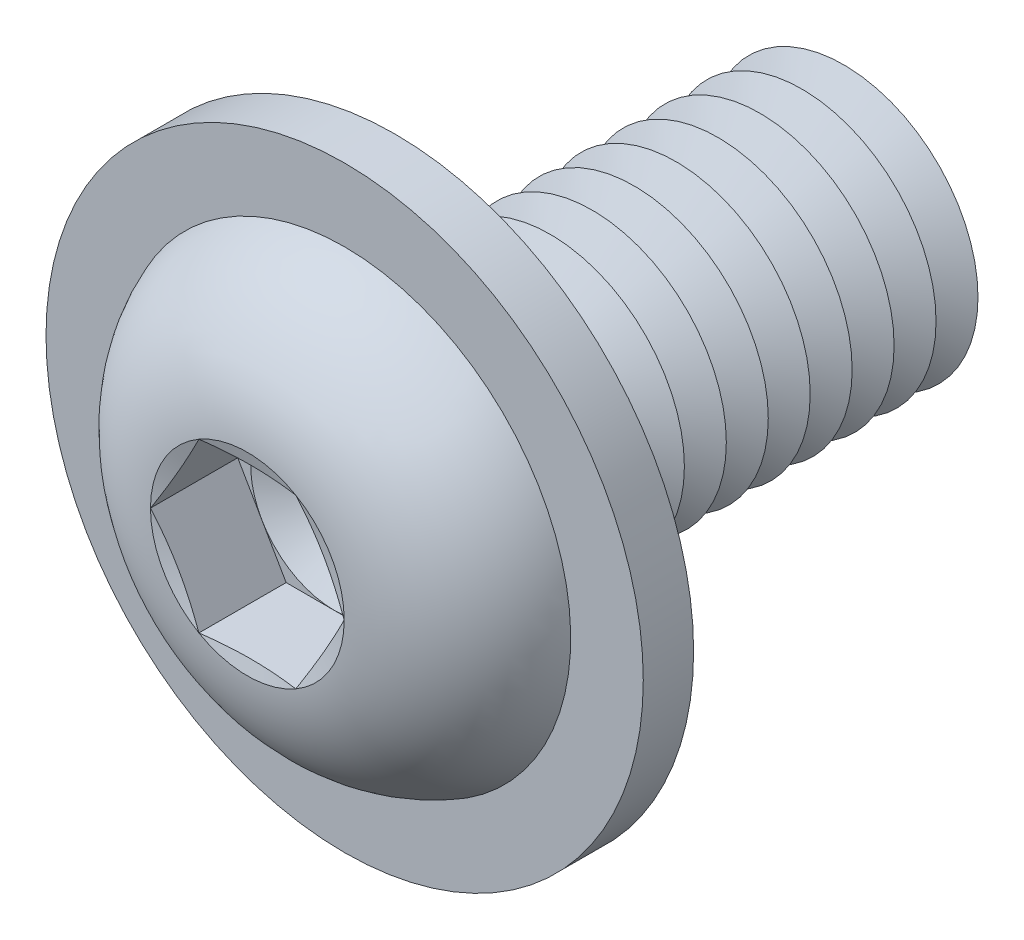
ISO-10303-21;
HEADER;
FILE_DESCRIPTION(('STEP AP214'),'2;1');
FILE_NAME('part.step','',(''),(''),'','','');
FILE_SCHEMA(('AUTOMOTIVE_DESIGN { 1 0 10303 214 1 1 1 1 }'));
ENDSEC;
DATA;
#1=APPLICATION_CONTEXT('core data for automotive mechanical design processes');
#2=APPLICATION_PROTOCOL_DEFINITION('international standard','automotive_design',2000,#1);
#3=PRODUCT_CONTEXT('',#1,'mechanical');
#4=PRODUCT('Part','Part','',(#3));
#5=PRODUCT_RELATED_PRODUCT_CATEGORY('part','',(#4));
#6=PRODUCT_DEFINITION_FORMATION('','',#4);
#7=PRODUCT_DEFINITION_CONTEXT('part definition',#1,'design');
#8=PRODUCT_DEFINITION('design','',#6,#7);
#9=PRODUCT_DEFINITION_SHAPE('','',#8);
#10=(LENGTH_UNIT() NAMED_UNIT(*) SI_UNIT(.MILLI.,.METRE.));
#11=(NAMED_UNIT(*) PLANE_ANGLE_UNIT() SI_UNIT($,.RADIAN.));
#12=(NAMED_UNIT(*) SI_UNIT($,.STERADIAN.) SOLID_ANGLE_UNIT());
#13=UNCERTAINTY_MEASURE_WITH_UNIT(LENGTH_MEASURE(1.E-05),#10,'distance_accuracy_value','');
#14=(GEOMETRIC_REPRESENTATION_CONTEXT(3) GLOBAL_UNCERTAINTY_ASSIGNED_CONTEXT((#13)) GLOBAL_UNIT_ASSIGNED_CONTEXT((#10,
#11,#12)) REPRESENTATION_CONTEXT('',''));
#15=CARTESIAN_POINT('',(0.,0.,0.));
#16=DIRECTION('',(0.,0.,1.));
#17=DIRECTION('',(1.,0.,0.));
#18=AXIS2_PLACEMENT_3D('',#15,#16,#17);
#19=CARTESIAN_POINT('',(0.,0.,-9.625));
#20=DIRECTION('',(0.,0.,1.));
#21=DIRECTION('',(1.,0.,0.));
#22=AXIS2_PLACEMENT_3D('',#19,#20,#21);
#23=CONICAL_SURFACE('',#22,4.,1.0471975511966);
#24=CARTESIAN_POINT('',(0.,0.,-10.25));
#25=DIRECTION('',(0.,0.,1.));
#26=DIRECTION('',(1.,0.,0.));
#27=AXIS2_PLACEMENT_3D('',#24,#25,#26);
#28=CIRCLE('',#27,2.91746824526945);
#29=CARTESIAN_POINT('',(2.91746824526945,0.,-10.25));
#30=VERTEX_POINT('',#29);
#31=EDGE_CURVE('E299',#30,#30,#28,.T.);
#32=ORIENTED_EDGE('',*,*,#31,.T.);
#33=EDGE_LOOP('',(#32));
#34=FACE_BOUND('',#33,.T.);
#35=CARTESIAN_POINT('',(0.,0.,-9.62499999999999));
#36=DIRECTION('',(0.,0.,1.));
#37=DIRECTION('',(1.,0.,0.));
#38=AXIS2_PLACEMENT_3D('',#35,#36,#37);
#39=CIRCLE('',#38,4.);
#40=CARTESIAN_POINT('',(4.,0.,-9.62499999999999));
#41=VERTEX_POINT('',#40);
#42=EDGE_CURVE('E295',#41,#41,#39,.T.);
#43=ORIENTED_EDGE('',*,*,#42,.F.);
#44=EDGE_LOOP('',(#43));
#45=FACE_BOUND('',#44,.T.);
#46=ADVANCED_FACE('F39',(#34,#45),#23,.T.);
#47=CARTESIAN_POINT('',(0.,0.,-10.25));
#48=DIRECTION('',(0.,0.,-1.));
#49=DIRECTION('',(-1.,0.,0.));
#50=AXIS2_PLACEMENT_3D('',#47,#48,#49);
#51=CONICAL_SURFACE('',#50,2.91746824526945,1.0471975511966);
#52=CARTESIAN_POINT('',(0.,0.,-10.875));
#53=DIRECTION('',(0.,0.,1.));
#54=DIRECTION('',(1.,0.,0.));
#55=AXIS2_PLACEMENT_3D('',#52,#53,#54);
#56=CIRCLE('',#55,4.);
#57=CARTESIAN_POINT('',(4.,0.,-10.875));
#58=VERTEX_POINT('',#57);
#59=EDGE_CURVE('E303',#58,#58,#56,.T.);
#60=ORIENTED_EDGE('',*,*,#59,.T.);
#61=EDGE_LOOP('',(#60));
#62=FACE_BOUND('',#61,.T.);
#63=ORIENTED_EDGE('',*,*,#31,.F.);
#64=EDGE_LOOP('',(#63));
#65=FACE_BOUND('',#64,.T.);
#66=ADVANCED_FACE('F436',(#62,#65),#51,.T.);
#67=CARTESIAN_POINT('',(0.,4.00000000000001,-14.));
#68=DIRECTION('',(0.,0.,-1.));
#69=DIRECTION('',(-1.,0.,0.));
#70=AXIS2_PLACEMENT_3D('',#67,#68,#69);
#71=PLANE('',#70);
#72=CARTESIAN_POINT('',(0.,0.,-14.));
#73=DIRECTION('',(0.,0.,1.));
#74=DIRECTION('',(1.,0.,0.));
#75=AXIS2_PLACEMENT_3D('',#72,#73,#74);
#76=CIRCLE('',#75,2.91746824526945);
#77=CARTESIAN_POINT('',(2.91746824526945,0.,-14.));
#78=VERTEX_POINT('',#77);
#79=EDGE_CURVE('E323',#78,#78,#76,.T.);
#80=ORIENTED_EDGE('',*,*,#79,.F.);
#81=EDGE_LOOP('',(#80));
#82=FACE_BOUND('',#81,.T.);
#83=ADVANCED_FACE('F442',(#82),#71,.T.);
#84=CARTESIAN_POINT('',(0.,0.,-13.375));
#85=DIRECTION('',(0.,0.,1.));
#86=DIRECTION('',(1.,0.,0.));
#87=AXIS2_PLACEMENT_3D('',#84,#85,#86);
#88=CONICAL_SURFACE('',#87,4.,1.0471975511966);
#89=ORIENTED_EDGE('',*,*,#79,.T.);
#90=EDGE_LOOP('',(#89));
#91=FACE_BOUND('',#90,.T.);
#92=CARTESIAN_POINT('',(0.,0.,-13.375));
#93=DIRECTION('',(0.,0.,1.));
#94=DIRECTION('',(1.,0.,0.));
#95=AXIS2_PLACEMENT_3D('',#92,#93,#94);
#96=CIRCLE('',#95,4.);
#97=CARTESIAN_POINT('',(4.,0.,-13.375));
#98=VERTEX_POINT('',#97);
#99=EDGE_CURVE('E319',#98,#98,#96,.T.);
#100=ORIENTED_EDGE('',*,*,#99,.F.);
#101=EDGE_LOOP('',(#100));
#102=FACE_BOUND('',#101,.T.);
#103=ADVANCED_FACE('F461',(#91,#102),#88,.T.);
#104=CARTESIAN_POINT('',(0.,0.,-12.75));
#105=DIRECTION('',(0.,0.,-1.));
#106=DIRECTION('',(-1.,0.,0.));
#107=AXIS2_PLACEMENT_3D('',#104,#105,#106);
#108=CONICAL_SURFACE('',#107,2.91746824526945,1.0471975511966);
#109=ORIENTED_EDGE('',*,*,#99,.T.);
#110=EDGE_LOOP('',(#109));
#111=FACE_BOUND('',#110,.T.);
#112=CARTESIAN_POINT('',(0.,0.,-12.75));
#113=DIRECTION('',(0.,0.,1.));
#114=DIRECTION('',(1.,0.,0.));
#115=AXIS2_PLACEMENT_3D('',#112,#113,#114);
#116=CIRCLE('',#115,2.91746824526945);
#117=CARTESIAN_POINT('',(2.91746824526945,0.,-12.75));
#118=VERTEX_POINT('',#117);
#119=EDGE_CURVE('E315',#118,#118,#116,.T.);
#120=ORIENTED_EDGE('',*,*,#119,.F.);
#121=EDGE_LOOP('',(#120));
#122=FACE_BOUND('',#121,.T.);
#123=ADVANCED_FACE('F458',(#111,#122),#108,.T.);
#124=CARTESIAN_POINT('',(0.,0.,-12.125));
#125=DIRECTION('',(0.,0.,1.));
#126=DIRECTION('',(1.,0.,0.));
#127=AXIS2_PLACEMENT_3D('',#124,#125,#126);
#128=CONICAL_SURFACE('',#127,4.,1.0471975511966);
#129=ORIENTED_EDGE('',*,*,#119,.T.);
#130=EDGE_LOOP('',(#129));
#131=FACE_BOUND('',#130,.T.);
#132=CARTESIAN_POINT('',(0.,0.,-12.125));
#133=DIRECTION('',(0.,0.,1.));
#134=DIRECTION('',(1.,0.,0.));
#135=AXIS2_PLACEMENT_3D('',#132,#133,#134);
#136=CIRCLE('',#135,4.);
#137=CARTESIAN_POINT('',(4.,0.,-12.125));
#138=VERTEX_POINT('',#137);
#139=EDGE_CURVE('E311',#138,#138,#136,.T.);
#140=ORIENTED_EDGE('',*,*,#139,.F.);
#141=EDGE_LOOP('',(#140));
#142=FACE_BOUND('',#141,.T.);
#143=ADVANCED_FACE('F452',(#131,#142),#128,.T.);
#144=CARTESIAN_POINT('',(0.,0.,-11.5));
#145=DIRECTION('',(0.,0.,-1.));
#146=DIRECTION('',(-1.,0.,0.));
#147=AXIS2_PLACEMENT_3D('',#144,#145,#146);
#148=CONICAL_SURFACE('',#147,2.91746824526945,1.0471975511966);
#149=ORIENTED_EDGE('',*,*,#139,.T.);
#150=EDGE_LOOP('',(#149));
#151=FACE_BOUND('',#150,.T.);
#152=CARTESIAN_POINT('',(0.,0.,-11.5));
#153=DIRECTION('',(0.,0.,1.));
#154=DIRECTION('',(1.,0.,0.));
#155=AXIS2_PLACEMENT_3D('',#152,#153,#154);
#156=CIRCLE('',#155,2.91746824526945);
#157=CARTESIAN_POINT('',(2.91746824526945,0.,-11.5));
#158=VERTEX_POINT('',#157);
#159=EDGE_CURVE('E307',#158,#158,#156,.T.);
#160=ORIENTED_EDGE('',*,*,#159,.F.);
#161=EDGE_LOOP('',(#160));
#162=FACE_BOUND('',#161,.T.);
#163=ADVANCED_FACE('F448',(#151,#162),#148,.T.);
#164=CARTESIAN_POINT('',(0.,0.,-10.875));
#165=DIRECTION('',(0.,0.,1.));
#166=DIRECTION('',(1.,0.,0.));
#167=AXIS2_PLACEMENT_3D('',#164,#165,#166);
#168=CONICAL_SURFACE('',#167,4.,1.0471975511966);
#169=ORIENTED_EDGE('',*,*,#159,.T.);
#170=EDGE_LOOP('',(#169));
#171=FACE_BOUND('',#170,.T.);
#172=ORIENTED_EDGE('',*,*,#59,.F.);
#173=EDGE_LOOP('',(#172));
#174=FACE_BOUND('',#173,.T.);
#175=ADVANCED_FACE('F451',(#171,#174),#168,.T.);
#176=CARTESIAN_POINT('',(0.,0.,-8.375));
#177=DIRECTION('',(0.,0.,1.));
#178=DIRECTION('',(1.,0.,0.));
#179=AXIS2_PLACEMENT_3D('',#176,#177,#178);
#180=CONICAL_SURFACE('',#179,4.,1.0471975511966);
#181=CARTESIAN_POINT('',(0.,0.,-8.99999999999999));
#182=DIRECTION('',(0.,0.,1.));
#183=DIRECTION('',(1.,0.,0.));
#184=AXIS2_PLACEMENT_3D('',#181,#182,#183);
#185=CIRCLE('',#184,2.91746824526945);
#186=CARTESIAN_POINT('',(2.91746824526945,0.,-8.99999999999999));
#187=VERTEX_POINT('',#186);
#188=EDGE_CURVE('E291',#187,#187,#185,.T.);
#189=ORIENTED_EDGE('',*,*,#188,.T.);
#190=EDGE_LOOP('',(#189));
#191=FACE_BOUND('',#190,.T.);
#192=CARTESIAN_POINT('',(0.,0.,-8.37499999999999));
#193=DIRECTION('',(0.,0.,1.));
#194=DIRECTION('',(1.,0.,0.));
#195=AXIS2_PLACEMENT_3D('',#192,#193,#194);
#196=CIRCLE('',#195,4.);
#197=CARTESIAN_POINT('',(4.,0.,-8.37499999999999));
#198=VERTEX_POINT('',#197);
#199=EDGE_CURVE('E287',#198,#198,#196,.T.);
#200=ORIENTED_EDGE('',*,*,#199,.F.);
#201=EDGE_LOOP('',(#200));
#202=FACE_BOUND('',#201,.T.);
#203=ADVANCED_FACE('F456',(#191,#202),#180,.T.);
#204=CARTESIAN_POINT('',(0.,0.,-8.99999999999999));
#205=DIRECTION('',(0.,0.,-1.));
#206=DIRECTION('',(-1.,0.,0.));
#207=AXIS2_PLACEMENT_3D('',#204,#205,#206);
#208=CONICAL_SURFACE('',#207,2.91746824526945,1.0471975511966);
#209=ORIENTED_EDGE('',*,*,#42,.T.);
#210=EDGE_LOOP('',(#209));
#211=FACE_BOUND('',#210,.T.);
#212=ORIENTED_EDGE('',*,*,#188,.F.);
#213=EDGE_LOOP('',(#212));
#214=FACE_BOUND('',#213,.T.);
#215=ADVANCED_FACE('F507',(#211,#214),#208,.T.);
#216=CARTESIAN_POINT('',(0.,0.,-7.125));
#217=DIRECTION('',(0.,0.,1.));
#218=DIRECTION('',(1.,0.,0.));
#219=AXIS2_PLACEMENT_3D('',#216,#217,#218);
#220=CONICAL_SURFACE('',#219,4.,1.0471975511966);
#221=CARTESIAN_POINT('',(0.,0.,-7.74999999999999));
#222=DIRECTION('',(0.,0.,1.));
#223=DIRECTION('',(1.,0.,0.));
#224=AXIS2_PLACEMENT_3D('',#221,#222,#223);
#225=CIRCLE('',#224,2.91746824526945);
#226=CARTESIAN_POINT('',(2.91746824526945,0.,-7.74999999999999));
#227=VERTEX_POINT('',#226);
#228=EDGE_CURVE('E283',#227,#227,#225,.T.);
#229=ORIENTED_EDGE('',*,*,#228,.T.);
#230=EDGE_LOOP('',(#229));
#231=FACE_BOUND('',#230,.T.);
#232=CARTESIAN_POINT('',(0.,0.,-7.125));
#233=DIRECTION('',(0.,0.,1.));
#234=DIRECTION('',(1.,0.,0.));
#235=AXIS2_PLACEMENT_3D('',#232,#233,#234);
#236=CIRCLE('',#235,4.);
#237=CARTESIAN_POINT('',(4.,0.,-7.125));
#238=VERTEX_POINT('',#237);
#239=EDGE_CURVE('E279',#238,#238,#236,.T.);
#240=ORIENTED_EDGE('',*,*,#239,.F.);
#241=EDGE_LOOP('',(#240));
#242=FACE_BOUND('',#241,.T.);
#243=ADVANCED_FACE('F513',(#231,#242),#220,.T.);
#244=CARTESIAN_POINT('',(0.,0.,-7.74999999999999));
#245=DIRECTION('',(0.,0.,-1.));
#246=DIRECTION('',(-1.,0.,0.));
#247=AXIS2_PLACEMENT_3D('',#244,#245,#246);
#248=CONICAL_SURFACE('',#247,2.91746824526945,1.0471975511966);
#249=ORIENTED_EDGE('',*,*,#199,.T.);
#250=EDGE_LOOP('',(#249));
#251=FACE_BOUND('',#250,.T.);
#252=ORIENTED_EDGE('',*,*,#228,.F.);
#253=EDGE_LOOP('',(#252));
#254=FACE_BOUND('',#253,.T.);
#255=ADVANCED_FACE('F520',(#251,#254),#248,.T.);
#256=CARTESIAN_POINT('',(0.,0.,-5.875));
#257=DIRECTION('',(0.,0.,1.));
#258=DIRECTION('',(1.,0.,0.));
#259=AXIS2_PLACEMENT_3D('',#256,#257,#258);
#260=CONICAL_SURFACE('',#259,4.,1.0471975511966);
#261=CARTESIAN_POINT('',(0.,0.,-6.5));
#262=DIRECTION('',(0.,0.,1.));
#263=DIRECTION('',(1.,0.,0.));
#264=AXIS2_PLACEMENT_3D('',#261,#262,#263);
#265=CIRCLE('',#264,2.91746824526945);
#266=CARTESIAN_POINT('',(2.91746824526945,0.,-6.5));
#267=VERTEX_POINT('',#266);
#268=EDGE_CURVE('E275',#267,#267,#265,.T.);
#269=ORIENTED_EDGE('',*,*,#268,.T.);
#270=EDGE_LOOP('',(#269));
#271=FACE_BOUND('',#270,.T.);
#272=CARTESIAN_POINT('',(0.,0.,-5.87499999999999));
#273=DIRECTION('',(0.,0.,1.));
#274=DIRECTION('',(1.,0.,0.));
#275=AXIS2_PLACEMENT_3D('',#272,#273,#274);
#276=CIRCLE('',#275,4.);
#277=CARTESIAN_POINT('',(4.,0.,-5.87499999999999));
#278=VERTEX_POINT('',#277);
#279=EDGE_CURVE('E271',#278,#278,#276,.T.);
#280=ORIENTED_EDGE('',*,*,#279,.F.);
#281=EDGE_LOOP('',(#280));
#282=FACE_BOUND('',#281,.T.);
#283=ADVANCED_FACE('F527',(#271,#282),#260,.T.);
#284=CARTESIAN_POINT('',(0.,0.,-6.5));
#285=DIRECTION('',(0.,0.,-1.));
#286=DIRECTION('',(-1.,0.,0.));
#287=AXIS2_PLACEMENT_3D('',#284,#285,#286);
#288=CONICAL_SURFACE('',#287,2.91746824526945,1.0471975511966);
#289=ORIENTED_EDGE('',*,*,#239,.T.);
#290=EDGE_LOOP('',(#289));
#291=FACE_BOUND('',#290,.T.);
#292=ORIENTED_EDGE('',*,*,#268,.F.);
#293=EDGE_LOOP('',(#292));
#294=FACE_BOUND('',#293,.T.);
#295=ADVANCED_FACE('F534',(#291,#294),#288,.T.);
#296=CARTESIAN_POINT('',(0.,0.,-4.625));
#297=DIRECTION('',(0.,0.,1.));
#298=DIRECTION('',(1.,0.,0.));
#299=AXIS2_PLACEMENT_3D('',#296,#297,#298);
#300=CONICAL_SURFACE('',#299,4.,1.0471975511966);
#301=CARTESIAN_POINT('',(0.,0.,-5.24999999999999));
#302=DIRECTION('',(0.,0.,1.));
#303=DIRECTION('',(1.,0.,0.));
#304=AXIS2_PLACEMENT_3D('',#301,#302,#303);
#305=CIRCLE('',#304,2.91746824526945);
#306=CARTESIAN_POINT('',(2.91746824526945,0.,-5.24999999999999));
#307=VERTEX_POINT('',#306);
#308=EDGE_CURVE('E267',#307,#307,#305,.T.);
#309=ORIENTED_EDGE('',*,*,#308,.T.);
#310=EDGE_LOOP('',(#309));
#311=FACE_BOUND('',#310,.T.);
#312=CARTESIAN_POINT('',(0.,0.,-4.625));
#313=DIRECTION('',(0.,0.,1.));
#314=DIRECTION('',(1.,0.,0.));
#315=AXIS2_PLACEMENT_3D('',#312,#313,#314);
#316=CIRCLE('',#315,4.);
#317=CARTESIAN_POINT('',(4.,0.,-4.625));
#318=VERTEX_POINT('',#317);
#319=EDGE_CURVE('E263',#318,#318,#316,.T.);
#320=ORIENTED_EDGE('',*,*,#319,.F.);
#321=EDGE_LOOP('',(#320));
#322=FACE_BOUND('',#321,.T.);
#323=ADVANCED_FACE('F541',(#311,#322),#300,.T.);
#324=CARTESIAN_POINT('',(0.,0.,-5.24999999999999));
#325=DIRECTION('',(0.,0.,-1.));
#326=DIRECTION('',(-1.,0.,0.));
#327=AXIS2_PLACEMENT_3D('',#324,#325,#326);
#328=CONICAL_SURFACE('',#327,2.91746824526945,1.0471975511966);
#329=ORIENTED_EDGE('',*,*,#279,.T.);
#330=EDGE_LOOP('',(#329));
#331=FACE_BOUND('',#330,.T.);
#332=ORIENTED_EDGE('',*,*,#308,.F.);
#333=EDGE_LOOP('',(#332));
#334=FACE_BOUND('',#333,.T.);
#335=ADVANCED_FACE('F548',(#331,#334),#328,.T.);
#336=CARTESIAN_POINT('',(0.,0.,-3.375));
#337=DIRECTION('',(0.,0.,1.));
#338=DIRECTION('',(1.,0.,0.));
#339=AXIS2_PLACEMENT_3D('',#336,#337,#338);
#340=CONICAL_SURFACE('',#339,4.,1.0471975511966);
#341=CARTESIAN_POINT('',(0.,0.,-3.99999999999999));
#342=DIRECTION('',(0.,0.,1.));
#343=DIRECTION('',(1.,0.,0.));
#344=AXIS2_PLACEMENT_3D('',#341,#342,#343);
#345=CIRCLE('',#344,2.91746824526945);
#346=CARTESIAN_POINT('',(2.91746824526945,0.,-3.99999999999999));
#347=VERTEX_POINT('',#346);
#348=EDGE_CURVE('E259',#347,#347,#345,.T.);
#349=ORIENTED_EDGE('',*,*,#348,.T.);
#350=EDGE_LOOP('',(#349));
#351=FACE_BOUND('',#350,.T.);
#352=CARTESIAN_POINT('',(0.,0.,-3.375));
#353=DIRECTION('',(0.,0.,1.));
#354=DIRECTION('',(1.,0.,0.));
#355=AXIS2_PLACEMENT_3D('',#352,#353,#354);
#356=CIRCLE('',#355,4.);
#357=CARTESIAN_POINT('',(4.,0.,-3.375));
#358=VERTEX_POINT('',#357);
#359=EDGE_CURVE('E255',#358,#358,#356,.T.);
#360=ORIENTED_EDGE('',*,*,#359,.F.);
#361=EDGE_LOOP('',(#360));
#362=FACE_BOUND('',#361,.T.);
#363=ADVANCED_FACE('F555',(#351,#362),#340,.T.);
#364=CARTESIAN_POINT('',(0.,0.,-3.99999999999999));
#365=DIRECTION('',(0.,0.,-1.));
#366=DIRECTION('',(-1.,0.,0.));
#367=AXIS2_PLACEMENT_3D('',#364,#365,#366);
#368=CONICAL_SURFACE('',#367,2.91746824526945,1.0471975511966);
#369=ORIENTED_EDGE('',*,*,#319,.T.);
#370=EDGE_LOOP('',(#369));
#371=FACE_BOUND('',#370,.T.);
#372=ORIENTED_EDGE('',*,*,#348,.F.);
#373=EDGE_LOOP('',(#372));
#374=FACE_BOUND('',#373,.T.);
#375=ADVANCED_FACE('F562',(#371,#374),#368,.T.);
#376=CARTESIAN_POINT('',(0.,0.,-2.125));
#377=DIRECTION('',(0.,0.,1.));
#378=DIRECTION('',(1.,0.,0.));
#379=AXIS2_PLACEMENT_3D('',#376,#377,#378);
#380=CONICAL_SURFACE('',#379,4.,1.0471975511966);
#381=CARTESIAN_POINT('',(0.,0.,-2.75));
#382=DIRECTION('',(0.,0.,1.));
#383=DIRECTION('',(1.,0.,0.));
#384=AXIS2_PLACEMENT_3D('',#381,#382,#383);
#385=CIRCLE('',#384,2.91746824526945);
#386=CARTESIAN_POINT('',(2.91746824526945,0.,-2.75));
#387=VERTEX_POINT('',#386);
#388=EDGE_CURVE('E251',#387,#387,#385,.T.);
#389=ORIENTED_EDGE('',*,*,#388,.T.);
#390=EDGE_LOOP('',(#389));
#391=FACE_BOUND('',#390,.T.);
#392=CARTESIAN_POINT('',(0.,0.,-2.125));
#393=DIRECTION('',(0.,0.,1.));
#394=DIRECTION('',(1.,0.,0.));
#395=AXIS2_PLACEMENT_3D('',#392,#393,#394);
#396=CIRCLE('',#395,4.);
#397=CARTESIAN_POINT('',(4.,0.,-2.125));
#398=VERTEX_POINT('',#397);
#399=EDGE_CURVE('E243',#398,#398,#396,.T.);
#400=ORIENTED_EDGE('',*,*,#399,.F.);
#401=EDGE_LOOP('',(#400));
#402=FACE_BOUND('',#401,.T.);
#403=ADVANCED_FACE('F569',(#391,#402),#380,.T.);
#404=CARTESIAN_POINT('',(0.,0.,-2.75));
#405=DIRECTION('',(0.,0.,-1.));
#406=DIRECTION('',(-1.,0.,0.));
#407=AXIS2_PLACEMENT_3D('',#404,#405,#406);
#408=CONICAL_SURFACE('',#407,2.91746824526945,1.0471975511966);
#409=ORIENTED_EDGE('',*,*,#359,.T.);
#410=EDGE_LOOP('',(#409));
#411=FACE_BOUND('',#410,.T.);
#412=ORIENTED_EDGE('',*,*,#388,.F.);
#413=EDGE_LOOP('',(#412));
#414=FACE_BOUND('',#413,.T.);
#415=ADVANCED_FACE('F576',(#411,#414),#408,.T.);
#416=CARTESIAN_POINT('',(0.,0.,-0.874999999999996));
#417=DIRECTION('',(0.,0.,1.));
#418=DIRECTION('',(1.,0.,0.));
#419=AXIS2_PLACEMENT_3D('',#416,#417,#418);
#420=CONICAL_SURFACE('',#419,4.,1.0471975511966);
#421=CARTESIAN_POINT('',(0.,0.,-1.49999999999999));
#422=DIRECTION('',(0.,0.,1.));
#423=DIRECTION('',(1.,0.,0.));
#424=AXIS2_PLACEMENT_3D('',#421,#422,#423);
#425=CIRCLE('',#424,2.91746824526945);
#426=CARTESIAN_POINT('',(2.91746824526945,0.,-1.49999999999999));
#427=VERTEX_POINT('',#426);
#428=EDGE_CURVE('E232',#427,#427,#425,.T.);
#429=ORIENTED_EDGE('',*,*,#428,.T.);
#430=EDGE_LOOP('',(#429));
#431=FACE_BOUND('',#430,.T.);
#432=CARTESIAN_POINT('',(0.,0.,-0.874999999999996));
#433=DIRECTION('',(0.,0.,1.));
#434=DIRECTION('',(1.,0.,0.));
#435=AXIS2_PLACEMENT_3D('',#432,#433,#434);
#436=CIRCLE('',#435,4.);
#437=CARTESIAN_POINT('',(4.,0.,-0.874999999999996));
#438=VERTEX_POINT('',#437);
#439=EDGE_CURVE('E247',#438,#438,#436,.T.);
#440=ORIENTED_EDGE('',*,*,#439,.F.);
#441=EDGE_LOOP('',(#440));
#442=FACE_BOUND('',#441,.T.);
#443=ADVANCED_FACE('F583',(#431,#442),#420,.T.);
#444=CARTESIAN_POINT('',(0.,0.,-1.49999999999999));
#445=DIRECTION('',(0.,0.,-1.));
#446=DIRECTION('',(-1.,0.,0.));
#447=AXIS2_PLACEMENT_3D('',#444,#445,#446);
#448=CONICAL_SURFACE('',#447,2.91746824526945,1.0471975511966);
#449=ORIENTED_EDGE('',*,*,#399,.T.);
#450=EDGE_LOOP('',(#449));
#451=FACE_BOUND('',#450,.T.);
#452=ORIENTED_EDGE('',*,*,#428,.F.);
#453=EDGE_LOOP('',(#452));
#454=FACE_BOUND('',#453,.T.);
#455=ADVANCED_FACE('F221',(#451,#454),#448,.T.);
#456=CARTESIAN_POINT('',(0.,4.,0.));
#457=DIRECTION('',(0.,0.,-1.));
#458=DIRECTION('',(-1.,0.,0.));
#459=AXIS2_PLACEMENT_3D('',#456,#457,#458);
#460=PLANE('',#459);
#461=CARTESIAN_POINT('',(0.,0.,0.));
#462=DIRECTION('',(0.,0.,-1.));
#463=DIRECTION('',(-1.,0.,0.));
#464=AXIS2_PLACEMENT_3D('',#461,#462,#463);
#465=CIRCLE('',#464,4.625);
#466=CARTESIAN_POINT('',(-4.625,0.,0.));
#467=VERTEX_POINT('',#466);
#468=EDGE_CURVE('E337',#467,#467,#465,.F.);
#469=ORIENTED_EDGE('',*,*,#468,.T.);
#470=EDGE_LOOP('',(#469));
#471=FACE_BOUND('',#470,.T.);
#472=CARTESIAN_POINT('',(0.,0.,0.));
#473=DIRECTION('',(0.,0.,-1.));
#474=DIRECTION('',(0.,1.,0.));
#475=AXIS2_PLACEMENT_3D('',#472,#473,#474);
#476=CIRCLE('',#475,8.9);
#477=CARTESIAN_POINT('',(0.,8.9,0.));
#478=VERTEX_POINT('',#477);
#479=EDGE_CURVE('E904',#478,#478,#476,.T.);
#480=ORIENTED_EDGE('',*,*,#479,.T.);
#481=EDGE_LOOP('',(#480));
#482=FACE_BOUND('',#481,.T.);
#483=ADVANCED_FACE('F595',(#471,#482),#460,.T.);
#484=CARTESIAN_POINT('',(0.,0.,-0.624999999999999));
#485=DIRECTION('',(0.,0.,-1.));
#486=DIRECTION('',(-1.,0.,0.));
#487=AXIS2_PLACEMENT_3D('',#484,#485,#486);
#488=TOROIDAL_SURFACE('',#487,4.625,0.625);
#489=ORIENTED_EDGE('',*,*,#468,.F.);
#490=EDGE_LOOP('',(#489));
#491=FACE_BOUND('',#490,.T.);
#492=CARTESIAN_POINT('',(0.,0.,-0.624999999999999));
#493=DIRECTION('',(0.,0.,-1.));
#494=DIRECTION('',(-1.,0.,0.));
#495=AXIS2_PLACEMENT_3D('',#492,#493,#494);
#496=CIRCLE('',#495,4.);
#497=CARTESIAN_POINT('',(-4.,0.,-0.624999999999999));
#498=VERTEX_POINT('',#497);
#499=EDGE_CURVE('E332',#498,#498,#496,.T.);
#500=ORIENTED_EDGE('',*,*,#499,.F.);
#501=EDGE_LOOP('',(#500));
#502=FACE_BOUND('',#501,.T.);
#503=ADVANCED_FACE('F41',(#491,#502),#488,.F.);
#504=CARTESIAN_POINT('',(0.,0.,-14.));
#505=DIRECTION('',(0.,0.,-1.));
#506=DIRECTION('',(-1.,0.,0.));
#507=AXIS2_PLACEMENT_3D('',#504,#505,#506);
#508=CYLINDRICAL_SURFACE('',#507,4.);
#509=ORIENTED_EDGE('',*,*,#499,.T.);
#510=EDGE_LOOP('',(#509));
#511=FACE_BOUND('',#510,.T.);
#512=ORIENTED_EDGE('',*,*,#439,.T.);
#513=EDGE_LOOP('',(#512));
#514=FACE_BOUND('',#513,.T.);
#515=ADVANCED_FACE('F607',(#511,#514),#508,.T.);
#516=CARTESIAN_POINT('',(0.,0.,1.5));
#517=DIRECTION('',(0.,0.,-1.));
#518=DIRECTION('',(0.,1.,0.));
#519=AXIS2_PLACEMENT_3D('',#516,#517,#518);
#520=CYLINDRICAL_SURFACE('',#519,8.9);
#521=CARTESIAN_POINT('',(0.,0.,1.5));
#522=DIRECTION('',(0.,0.,-1.));
#523=DIRECTION('',(0.,1.,0.));
#524=AXIS2_PLACEMENT_3D('',#521,#522,#523);
#525=CIRCLE('',#524,8.9);
#526=CARTESIAN_POINT('',(0.,8.9,1.5));
#527=VERTEX_POINT('',#526);
#528=EDGE_CURVE('E902',#527,#527,#525,.T.);
#529=ORIENTED_EDGE('',*,*,#528,.T.);
#530=EDGE_LOOP('',(#529));
#531=FACE_BOUND('',#530,.T.);
#532=ORIENTED_EDGE('',*,*,#479,.F.);
#533=EDGE_LOOP('',(#532));
#534=FACE_BOUND('',#533,.T.);
#535=ADVANCED_FACE('F613',(#531,#534),#520,.T.);
#536=CARTESIAN_POINT('',(0.,0.,1.5));
#537=DIRECTION('',(0.,0.,-1.));
#538=DIRECTION('',(0.,1.,0.));
#539=AXIS2_PLACEMENT_3D('',#536,#537,#538);
#540=PLANE('',#539);
#541=CARTESIAN_POINT('',(0.,0.,1.5));
#542=DIRECTION('',(0.,0.,-1.));
#543=DIRECTION('',(0.,1.,0.));
#544=AXIS2_PLACEMENT_3D('',#541,#542,#543);
#545=CIRCLE('',#544,6.73705889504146);
#546=CARTESIAN_POINT('',(0.,6.73705889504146,1.5));
#547=VERTEX_POINT('',#546);
#548=EDGE_CURVE('E43',#547,#547,#545,.F.);
#549=ORIENTED_EDGE('',*,*,#548,.F.);
#550=EDGE_LOOP('',(#549));
#551=FACE_BOUND('',#550,.T.);
#552=ORIENTED_EDGE('',*,*,#528,.F.);
#553=EDGE_LOOP('',(#552));
#554=FACE_BOUND('',#553,.T.);
#555=ADVANCED_FACE('F117',(#551,#554),#540,.F.);
#556=CARTESIAN_POINT('',(0.,0.,1.8));
#557=DIRECTION('',(0.,0.,1.));
#558=DIRECTION('',(1.,0.,0.));
#559=AXIS2_PLACEMENT_3D('',#556,#557,#558);
#560=CONICAL_SURFACE('',#559,2.49999883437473,1.0471975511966);
#561=CARTESIAN_POINT('',(0.,0.,0.35662500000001));
#562=VERTEX_POINT('',#561);
#563=VERTEX_LOOP('',#562);
#564=FACE_BOUND('',#563,.T.);
#565=CARTESIAN_POINT('',(0.,0.,1.8));
#566=DIRECTION('',(0.,0.,1.));
#567=DIRECTION('',(1.,0.,0.));
#568=AXIS2_PLACEMENT_3D('',#565,#566,#567);
#569=CIRCLE('',#568,2.49999883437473);
#570=CARTESIAN_POINT('',(2.1650625,1.24999941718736,1.8));
#571=VERTEX_POINT('',#570);
#572=CARTESIAN_POINT('',(0.,2.49999883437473,1.8));
#573=VERTEX_POINT('',#572);
#574=EDGE_CURVE('E120',#571,#573,#569,.T.);
#575=ORIENTED_EDGE('',*,*,#574,.T.);
#576=CARTESIAN_POINT('',(0.,0.,1.8));
#577=DIRECTION('',(0.,0.,1.));
#578=DIRECTION('',(1.,0.,0.));
#579=AXIS2_PLACEMENT_3D('',#576,#577,#578);
#580=CIRCLE('',#579,2.49999883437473);
#581=CARTESIAN_POINT('',(-2.1650625,1.24999941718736,1.8));
#582=VERTEX_POINT('',#581);
#583=EDGE_CURVE('E11',#573,#582,#580,.T.);
#584=ORIENTED_EDGE('',*,*,#583,.T.);
#585=CARTESIAN_POINT('',(-2.1650625,-1.24999941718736,1.8));
#586=VERTEX_POINT('',#585);
#587=EDGE_CURVE('E49',#582,#586,#580,.T.);
#588=ORIENTED_EDGE('',*,*,#587,.T.);
#589=CARTESIAN_POINT('',(0.,-2.49999883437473,1.8));
#590=VERTEX_POINT('',#589);
#591=EDGE_CURVE('E344',#586,#590,#580,.T.);
#592=ORIENTED_EDGE('',*,*,#591,.T.);
#593=CARTESIAN_POINT('',(2.1650625,-1.24999941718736,1.8));
#594=VERTEX_POINT('',#593);
#595=EDGE_CURVE('E57',#590,#594,#580,.T.);
#596=ORIENTED_EDGE('',*,*,#595,.T.);
#597=EDGE_CURVE('E50',#594,#571,#580,.T.);
#598=ORIENTED_EDGE('',*,*,#597,.T.);
#599=EDGE_LOOP('',(#575,#584,#588,#592,#596,#598));
#600=FACE_BOUND('',#599,.T.);
#601=ADVANCED_FACE('F114',(#564,#600),#560,.F.);
#602=CARTESIAN_POINT('',(0.,0.,1.8));
#603=DIRECTION('',(0.,0.,1.));
#604=DIRECTION('',(1.,0.,0.));
#605=AXIS2_PLACEMENT_3D('',#602,#603,#604);
#606=PLANE('',#605);
#607=ORIENTED_EDGE('',*,*,#591,.F.);
#608=DIRECTION('',(0.5,-0.866025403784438,0.));
#609=VECTOR('',#608,1.);
#610=CARTESIAN_POINT('',(-2.88675,0.,1.8));
#611=LINE('',#610,#609);
#612=CARTESIAN_POINT('',(-1.443375,-2.49999883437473,1.8));
#613=VERTEX_POINT('',#612);
#614=EDGE_CURVE('E154',#586,#613,#611,.T.);
#615=ORIENTED_EDGE('',*,*,#614,.T.);
#616=DIRECTION('',(1.,0.,0.));
#617=VECTOR('',#616,1.);
#618=CARTESIAN_POINT('',(-1.443375,-2.49999883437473,1.8));
#619=LINE('',#618,#617);
#620=EDGE_CURVE('E160',#613,#590,#619,.T.);
#621=ORIENTED_EDGE('',*,*,#620,.T.);
#622=EDGE_LOOP('',(#607,#615,#621));
#623=FACE_BOUND('',#622,.T.);
#624=ADVANCED_FACE('F116',(#623),#606,.T.);
#625=ORIENTED_EDGE('',*,*,#595,.F.);
#626=CARTESIAN_POINT('',(1.443375,-2.49999883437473,1.8));
#627=VERTEX_POINT('',#626);
#628=EDGE_CURVE('E159',#590,#627,#619,.T.);
#629=ORIENTED_EDGE('',*,*,#628,.T.);
#630=DIRECTION('',(0.5,0.866025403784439,0.));
#631=VECTOR('',#630,1.);
#632=CARTESIAN_POINT('',(1.443375,-2.49999883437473,1.8));
#633=LINE('',#632,#631);
#634=EDGE_CURVE('E165',#627,#594,#633,.T.);
#635=ORIENTED_EDGE('',*,*,#634,.T.);
#636=EDGE_LOOP('',(#625,#629,#635));
#637=FACE_BOUND('',#636,.T.);
#638=ADVANCED_FACE('F634',(#637),#606,.T.);
#639=ORIENTED_EDGE('',*,*,#597,.F.);
#640=CARTESIAN_POINT('',(2.88675,0.,1.8));
#641=VERTEX_POINT('',#640);
#642=EDGE_CURVE('E164',#594,#641,#633,.T.);
#643=ORIENTED_EDGE('',*,*,#642,.T.);
#644=DIRECTION('',(-0.5,0.866025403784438,0.));
#645=VECTOR('',#644,1.);
#646=CARTESIAN_POINT('',(2.88675,0.,1.8));
#647=LINE('',#646,#645);
#648=EDGE_CURVE('E142',#641,#571,#647,.T.);
#649=ORIENTED_EDGE('',*,*,#648,.T.);
#650=EDGE_LOOP('',(#639,#643,#649));
#651=FACE_BOUND('',#650,.T.);
#652=ADVANCED_FACE('F400',(#651),#606,.T.);
#653=ORIENTED_EDGE('',*,*,#574,.F.);
#654=CARTESIAN_POINT('',(1.443375,2.49999883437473,1.8));
#655=VERTEX_POINT('',#654);
#656=EDGE_CURVE('E127',#571,#655,#647,.T.);
#657=ORIENTED_EDGE('',*,*,#656,.T.);
#658=DIRECTION('',(-1.,0.,0.));
#659=VECTOR('',#658,1.);
#660=CARTESIAN_POINT('',(1.443375,2.49999883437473,1.8));
#661=LINE('',#660,#659);
#662=EDGE_CURVE('E138',#655,#573,#661,.T.);
#663=ORIENTED_EDGE('',*,*,#662,.T.);
#664=EDGE_LOOP('',(#653,#657,#663));
#665=FACE_BOUND('',#664,.T.);
#666=ADVANCED_FACE('F144',(#665),#606,.T.);
#667=ORIENTED_EDGE('',*,*,#583,.F.);
#668=CARTESIAN_POINT('',(-1.443375,2.49999883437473,1.8));
#669=VERTEX_POINT('',#668);
#670=EDGE_CURVE('E133',#573,#669,#661,.T.);
#671=ORIENTED_EDGE('',*,*,#670,.T.);
#672=DIRECTION('',(-0.5,-0.866025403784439,0.));
#673=VECTOR('',#672,1.);
#674=CARTESIAN_POINT('',(-1.443375,2.49999883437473,1.8));
#675=LINE('',#674,#673);
#676=EDGE_CURVE('E136',#669,#582,#675,.T.);
#677=ORIENTED_EDGE('',*,*,#676,.T.);
#678=EDGE_LOOP('',(#667,#671,#677));
#679=FACE_BOUND('',#678,.T.);
#680=ADVANCED_FACE('F132',(#679),#606,.T.);
#681=ORIENTED_EDGE('',*,*,#587,.F.);
#682=CARTESIAN_POINT('',(-2.88675,0.,1.8));
#683=VERTEX_POINT('',#682);
#684=EDGE_CURVE('E146',#582,#683,#675,.T.);
#685=ORIENTED_EDGE('',*,*,#684,.T.);
#686=EDGE_CURVE('E155',#683,#586,#611,.T.);
#687=ORIENTED_EDGE('',*,*,#686,.T.);
#688=EDGE_LOOP('',(#681,#685,#687));
#689=FACE_BOUND('',#688,.T.);
#690=ADVANCED_FACE('F358',(#689),#606,.T.);
#691=CARTESIAN_POINT('',(-2.88675,0.,1.8));
#692=DIRECTION('',(-0.866025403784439,-0.5,0.));
#693=DIRECTION('',(0.5,-0.866025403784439,0.));
#694=AXIS2_PLACEMENT_3D('',#691,#692,#693);
#695=PLANE('',#694);
#696=CARTESIAN_POINT('',(-2.88686547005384,0.000200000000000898,4.40003094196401));
#697=CARTESIAN_POINT('',(-2.82691617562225,-0.103635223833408,4.3839595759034));
#698=CARTESIAN_POINT('',(-2.76685817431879,-0.207658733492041,4.36936933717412));
#699=CARTESIAN_POINT('',(-2.64653003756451,-0.416073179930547,4.3437355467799));
#700=CARTESIAN_POINT('',(-2.58625982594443,-0.520464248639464,4.33269343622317));
#701=CARTESIAN_POINT('',(-2.46587274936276,-0.728980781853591,4.31480063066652));
#702=CARTESIAN_POINT('',(-2.40575669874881,-0.833104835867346,4.3079285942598));
#703=CARTESIAN_POINT('',(-2.28544792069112,-1.0414857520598,4.29871388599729));
#704=CARTESIAN_POINT('',(-2.22525521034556,-1.14574258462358,4.29637033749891));
#705=CARTESIAN_POINT('',(-2.10486978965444,-1.35425624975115,4.29637033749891));
#706=CARTESIAN_POINT('',(-2.04467707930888,-1.45851308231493,4.29871388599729));
#707=CARTESIAN_POINT('',(-1.92436830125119,-1.66689399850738,4.3079285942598));
#708=CARTESIAN_POINT('',(-1.86425225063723,-1.77101805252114,4.31480063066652));
#709=CARTESIAN_POINT('',(-1.74386517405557,-1.97953458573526,4.33269343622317));
#710=CARTESIAN_POINT('',(-1.68359496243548,-2.08392565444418,4.3437355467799));
#711=CARTESIAN_POINT('',(-1.56326682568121,-2.29234010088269,4.36936933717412));
#712=CARTESIAN_POINT('',(-1.50320882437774,-2.39636361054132,4.3839595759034));
#713=CARTESIAN_POINT('',(-1.44325952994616,-2.50019883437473,4.40003094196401));
#714=B_SPLINE_CURVE_WITH_KNOTS('',3,(#696,#697,#698,#699,#700,#701,#702,#703,#704,#705,#706,
#707,#708,#709,#710,#711,#712,#713),.UNSPECIFIED.,.F.,.F.,(4,2,2,2,2,2,2,2,4),(0.,
0.362931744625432,0.726010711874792,1.08721550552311,1.44835036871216,1.8094852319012,
2.17069002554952,2.53376899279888,2.89670073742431),.UNSPECIFIED.);
#715=CARTESIAN_POINT('',(-2.88675,0.,4.4));
#716=VERTEX_POINT('',#715);
#717=CARTESIAN_POINT('',(-1.443375,-2.49999883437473,4.4));
#718=VERTEX_POINT('',#717);
#719=EDGE_CURVE('E363',#716,#718,#714,.T.);
#720=ORIENTED_EDGE('',*,*,#719,.T.);
#721=DIRECTION('',(0.,0.,1.));
#722=VECTOR('',#721,1.);
#723=CARTESIAN_POINT('',(-1.443375,-2.49999883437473,1.8));
#724=LINE('',#723,#722);
#725=EDGE_CURVE('E178',#613,#718,#724,.T.);
#726=ORIENTED_EDGE('',*,*,#725,.F.);
#727=ORIENTED_EDGE('',*,*,#614,.F.);
#728=ORIENTED_EDGE('',*,*,#686,.F.);
#729=DIRECTION('',(0.,0.,1.));
#730=VECTOR('',#729,1.);
#731=CARTESIAN_POINT('',(-2.88675,0.,1.8));
#732=LINE('',#731,#730);
#733=EDGE_CURVE('E182',#683,#716,#732,.T.);
#734=ORIENTED_EDGE('',*,*,#733,.T.);
#735=EDGE_LOOP('',(#720,#726,#727,#728,#734));
#736=FACE_BOUND('',#735,.T.);
#737=ADVANCED_FACE('F356',(#736),#695,.F.);
#738=CARTESIAN_POINT('',(-1.443375,-2.49999883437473,1.8));
#739=DIRECTION('',(0.,-1.,0.));
#740=DIRECTION('',(1.,0.,0.));
#741=AXIS2_PLACEMENT_3D('',#738,#739,#740);
#742=PLANE('',#741);
#743=CARTESIAN_POINT('',(-4.35611719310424,-2.49999883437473,4.97227902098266));
#744=CARTESIAN_POINT('',(-4.25066509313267,-2.49999883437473,4.94777440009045));
#745=CARTESIAN_POINT('',(-4.14516541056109,-2.49999883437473,4.92347459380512));
#746=CARTESIAN_POINT('',(-3.93405094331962,-2.49999883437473,4.87537247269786));
#747=CARTESIAN_POINT('',(-3.82843615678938,-2.49999883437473,4.85157016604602));
#748=CARTESIAN_POINT('',(-3.5113534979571,-2.49999883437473,4.78103338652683));
#749=CARTESIAN_POINT('',(-3.29968815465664,-2.49999883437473,4.73517861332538));
#750=CARTESIAN_POINT('',(-2.87365524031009,-2.49999883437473,4.64645582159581));
#751=CARTESIAN_POINT('',(-2.65928093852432,-2.49999883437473,4.60361983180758));
#752=CARTESIAN_POINT('',(-2.22952626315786,-2.49999883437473,4.52311285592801));
#753=CARTESIAN_POINT('',(-2.01414580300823,-2.49999883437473,4.48544232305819));
#754=CARTESIAN_POINT('',(-1.58798319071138,-2.49999883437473,4.41876559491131));
#755=CARTESIAN_POINT('',(-1.37723418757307,-2.49999883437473,4.38955265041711));
#756=CARTESIAN_POINT('',(-0.954530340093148,-2.49999883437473,4.34171384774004));
#757=CARTESIAN_POINT('',(-0.742575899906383,-2.49999883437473,4.32308463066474));
#758=CARTESIAN_POINT('',(-0.424544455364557,-2.49999883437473,4.30539140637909));
#759=CARTESIAN_POINT('',(-0.318745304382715,-2.49999883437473,4.30120018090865));
#760=CARTESIAN_POINT('',(-0.107062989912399,-2.49999883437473,4.29638997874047));
#761=CARTESIAN_POINT('',(-0.00117982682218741,-2.49999883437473,4.29577098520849));
#762=CARTESIAN_POINT('',(0.210552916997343,-2.49999883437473,4.29814378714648));
#763=CARTESIAN_POINT('',(0.316402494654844,-2.49999883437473,4.30113585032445));
#764=CARTESIAN_POINT('',(0.527944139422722,-2.49999883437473,4.31057322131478));
#765=CARTESIAN_POINT('',(0.633636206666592,-2.49999883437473,4.31701852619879));
#766=CARTESIAN_POINT('',(0.890304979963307,-2.49999883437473,4.33652018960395));
#767=CARTESIAN_POINT('',(1.0411561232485,-2.49999883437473,4.35122885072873));
#768=CARTESIAN_POINT('',(1.34222474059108,-2.49999883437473,4.38593609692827));
#769=CARTESIAN_POINT('',(1.49244223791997,-2.49999883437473,4.40593448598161));
#770=CARTESIAN_POINT('',(1.79273634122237,-2.49999883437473,4.45011321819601));
#771=CARTESIAN_POINT('',(1.94281100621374,-2.49999883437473,4.47430656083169));
#772=CARTESIAN_POINT('',(2.24242097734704,-2.49999883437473,4.52583552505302));
#773=CARTESIAN_POINT('',(2.39195625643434,-2.49999883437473,4.55317130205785));
#774=CARTESIAN_POINT('',(2.69364402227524,-2.49999883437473,4.61079781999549));
#775=CARTESIAN_POINT('',(2.8457870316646,-2.49999883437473,4.64113779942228));
#776=CARTESIAN_POINT('',(3.14969016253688,-2.49999883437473,4.70367638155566));
#777=CARTESIAN_POINT('',(3.30145027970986,-2.49999883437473,4.73587500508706));
#778=CARTESIAN_POINT('',(3.60383766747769,-2.49999883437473,4.80150275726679));
#779=CARTESIAN_POINT('',(3.75446660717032,-2.49999883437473,4.83492423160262));
#780=CARTESIAN_POINT('',(4.05546753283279,-2.49999883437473,4.90285814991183));
#781=CARTESIAN_POINT('',(4.2058395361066,-2.49999883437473,4.9373705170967));
#782=CARTESIAN_POINT('',(4.35611719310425,-2.49999883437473,4.97227902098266));
#783=B_SPLINE_CURVE_WITH_KNOTS('',3,(#743,#744,#745,#746,#747,#748,#749,#750,#751,#752,#753,
#754,#755,#756,#757,#758,#759,#760,#761,#762,#763,#764,#765,#766,#767,#768,#769,#770,#771,#772,
#773,#774,#775,#776,#777,#778,#779,#780,#781,#782),.UNSPECIFIED.,.F.,.F.,(4,2,2,2,2,2,2,2,2,2,2,
2,2,2,2,2,2,2,2,4),(0.,0.324785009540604,0.6495753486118,1.29928181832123,1.95507889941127,
2.61093348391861,3.24905289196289,3.88696967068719,4.204563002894,4.5221548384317,
4.83977022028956,5.15738533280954,5.61196030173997,6.06651842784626,6.52251118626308,
6.97852650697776,7.44392737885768,7.90933346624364,8.37220553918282,8.83504510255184),.UNSPECIFIED.);
#784=CARTESIAN_POINT('',(1.443375,-2.49999883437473,4.4));
#785=VERTEX_POINT('',#784);
#786=EDGE_CURVE('E370',#718,#785,#783,.T.);
#787=ORIENTED_EDGE('',*,*,#786,.T.);
#788=DIRECTION('',(0.,0.,1.));
#789=VECTOR('',#788,1.);
#790=CARTESIAN_POINT('',(1.443375,-2.49999883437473,1.8));
#791=LINE('',#790,#789);
#792=EDGE_CURVE('E174',#627,#785,#791,.T.);
#793=ORIENTED_EDGE('',*,*,#792,.F.);
#794=ORIENTED_EDGE('',*,*,#628,.F.);
#795=ORIENTED_EDGE('',*,*,#620,.F.);
#796=ORIENTED_EDGE('',*,*,#725,.T.);
#797=EDGE_LOOP('',(#787,#793,#794,#795,#796));
#798=FACE_BOUND('',#797,.T.);
#799=ADVANCED_FACE('F425',(#798),#742,.F.);
#800=CARTESIAN_POINT('',(1.443375,-2.49999883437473,1.8));
#801=DIRECTION('',(0.866025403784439,-0.5,0.));
#802=DIRECTION('',(0.5,0.866025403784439,0.));
#803=AXIS2_PLACEMENT_3D('',#800,#801,#802);
#804=PLANE('',#803);
#805=CARTESIAN_POINT('',(1.44325952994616,-2.50019883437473,4.40003094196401));
#806=CARTESIAN_POINT('',(1.50320882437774,-2.39636361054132,4.3839595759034));
#807=CARTESIAN_POINT('',(1.56326682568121,-2.29234010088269,4.36936933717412));
#808=CARTESIAN_POINT('',(1.68359496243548,-2.08392565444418,4.3437355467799));
#809=CARTESIAN_POINT('',(1.74386517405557,-1.97953458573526,4.33269343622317));
#810=CARTESIAN_POINT('',(1.86425225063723,-1.77101805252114,4.31480063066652));
#811=CARTESIAN_POINT('',(1.92436830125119,-1.66689399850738,4.3079285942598));
#812=CARTESIAN_POINT('',(2.04467707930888,-1.45851308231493,4.29871388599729));
#813=CARTESIAN_POINT('',(2.10486978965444,-1.35425624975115,4.29637033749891));
#814=CARTESIAN_POINT('',(2.22525521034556,-1.14574258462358,4.29637033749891));
#815=CARTESIAN_POINT('',(2.28544792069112,-1.0414857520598,4.29871388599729));
#816=CARTESIAN_POINT('',(2.40575669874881,-0.833104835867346,4.3079285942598));
#817=CARTESIAN_POINT('',(2.46587274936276,-0.728980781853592,4.31480063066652));
#818=CARTESIAN_POINT('',(2.58625982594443,-0.520464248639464,4.33269343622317));
#819=CARTESIAN_POINT('',(2.64653003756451,-0.416073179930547,4.3437355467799));
#820=CARTESIAN_POINT('',(2.76685817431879,-0.207658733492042,4.36936933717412));
#821=CARTESIAN_POINT('',(2.82691617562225,-0.103635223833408,4.3839595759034));
#822=CARTESIAN_POINT('',(2.88686547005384,0.000200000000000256,4.40003094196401));
#823=B_SPLINE_CURVE_WITH_KNOTS('',3,(#805,#806,#807,#808,#809,#810,#811,#812,#813,#814,#815,
#816,#817,#818,#819,#820,#821,#822),.UNSPECIFIED.,.F.,.F.,(4,2,2,2,2,2,2,2,4),(0.,
0.362931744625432,0.726010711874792,1.08721550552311,1.44835036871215,1.80948523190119,
2.17069002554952,2.53376899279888,2.89670073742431),.UNSPECIFIED.);
#824=CARTESIAN_POINT('',(2.88675,0.,4.4));
#825=VERTEX_POINT('',#824);
#826=EDGE_CURVE('E233',#785,#825,#823,.T.);
#827=ORIENTED_EDGE('',*,*,#826,.T.);
#828=DIRECTION('',(0.,0.,1.));
#829=VECTOR('',#828,1.);
#830=CARTESIAN_POINT('',(2.88675,0.,1.8));
#831=LINE('',#830,#829);
#832=EDGE_CURVE('E169',#641,#825,#831,.T.);
#833=ORIENTED_EDGE('',*,*,#832,.F.);
#834=ORIENTED_EDGE('',*,*,#642,.F.);
#835=ORIENTED_EDGE('',*,*,#634,.F.);
#836=ORIENTED_EDGE('',*,*,#792,.T.);
#837=EDGE_LOOP('',(#827,#833,#834,#835,#836));
#838=FACE_BOUND('',#837,.T.);
#839=ADVANCED_FACE('F219',(#838),#804,.F.);
#840=CARTESIAN_POINT('',(2.88675,0.,1.8));
#841=DIRECTION('',(0.866025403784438,0.5,0.));
#842=DIRECTION('',(-0.5,0.866025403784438,0.));
#843=AXIS2_PLACEMENT_3D('',#840,#841,#842);
#844=PLANE('',#843);
#845=CARTESIAN_POINT('',(2.88686547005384,-0.000199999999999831,4.40003094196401));
#846=CARTESIAN_POINT('',(2.82691617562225,0.103635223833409,4.3839595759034));
#847=CARTESIAN_POINT('',(2.76685817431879,0.207658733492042,4.36936933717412));
#848=CARTESIAN_POINT('',(2.64653003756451,0.416073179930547,4.3437355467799));
#849=CARTESIAN_POINT('',(2.58625982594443,0.520464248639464,4.33269343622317));
#850=CARTESIAN_POINT('',(2.46587274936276,0.728980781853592,4.31480063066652));
#851=CARTESIAN_POINT('',(2.40575669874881,0.833104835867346,4.3079285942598));
#852=CARTESIAN_POINT('',(2.28544792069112,1.0414857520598,4.29871388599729));
#853=CARTESIAN_POINT('',(2.22525521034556,1.14574258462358,4.29637033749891));
#854=CARTESIAN_POINT('',(2.10486978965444,1.35425624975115,4.29637033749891));
#855=CARTESIAN_POINT('',(2.04467707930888,1.45851308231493,4.29871388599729));
#856=CARTESIAN_POINT('',(1.92436830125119,1.66689399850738,4.3079285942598));
#857=CARTESIAN_POINT('',(1.86425225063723,1.77101805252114,4.31480063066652));
#858=CARTESIAN_POINT('',(1.74386517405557,1.97953458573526,4.33269343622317));
#859=CARTESIAN_POINT('',(1.68359496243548,2.08392565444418,4.3437355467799));
#860=CARTESIAN_POINT('',(1.56326682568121,2.29234010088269,4.36936933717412));
#861=CARTESIAN_POINT('',(1.50320882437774,2.39636361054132,4.3839595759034));
#862=CARTESIAN_POINT('',(1.44325952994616,2.50019883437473,4.40003094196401));
#863=B_SPLINE_CURVE_WITH_KNOTS('',3,(#845,#846,#847,#848,#849,#850,#851,#852,#853,#854,#855,
#856,#857,#858,#859,#860,#861,#862),.UNSPECIFIED.,.F.,.F.,(4,2,2,2,2,2,2,2,4),(0.,
0.362931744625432,0.726010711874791,1.08721550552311,1.44835036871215,1.80948523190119,
2.17069002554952,2.53376899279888,2.89670073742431),.UNSPECIFIED.);
#864=CARTESIAN_POINT('',(1.44337499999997,2.49999883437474,4.4));
#865=VERTEX_POINT('',#864);
#866=EDGE_CURVE('E224',#825,#865,#863,.T.);
#867=ORIENTED_EDGE('',*,*,#866,.T.);
#868=DIRECTION('',(0.,0.,1.));
#869=VECTOR('',#868,1.);
#870=CARTESIAN_POINT('',(1.443375,2.49999883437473,1.8));
#871=LINE('',#870,#869);
#872=EDGE_CURVE('E65',#655,#865,#871,.T.);
#873=ORIENTED_EDGE('',*,*,#872,.F.);
#874=ORIENTED_EDGE('',*,*,#656,.F.);
#875=ORIENTED_EDGE('',*,*,#648,.F.);
#876=ORIENTED_EDGE('',*,*,#832,.T.);
#877=EDGE_LOOP('',(#867,#873,#874,#875,#876));
#878=FACE_BOUND('',#877,.T.);
#879=ADVANCED_FACE('F213',(#878),#844,.F.);
#880=CARTESIAN_POINT('',(1.443375,2.49999883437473,1.8));
#881=DIRECTION('',(0.,1.,0.));
#882=DIRECTION('',(-1.,0.,0.));
#883=AXIS2_PLACEMENT_3D('',#880,#881,#882);
#884=PLANE('',#883);
#885=CARTESIAN_POINT('',(4.35611719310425,2.49999883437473,4.97227902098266));
#886=CARTESIAN_POINT('',(4.25066509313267,2.49999883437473,4.94777440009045));
#887=CARTESIAN_POINT('',(4.14516541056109,2.49999883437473,4.92347459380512));
#888=CARTESIAN_POINT('',(3.93405094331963,2.49999883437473,4.87537247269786));
#889=CARTESIAN_POINT('',(3.82843615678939,2.49999883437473,4.85157016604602));
#890=CARTESIAN_POINT('',(3.51135349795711,2.49999883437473,4.78103338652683));
#891=CARTESIAN_POINT('',(3.29968815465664,2.49999883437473,4.73517861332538));
#892=CARTESIAN_POINT('',(2.87365524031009,2.49999883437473,4.64645582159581));
#893=CARTESIAN_POINT('',(2.65928093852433,2.49999883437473,4.60361983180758));
#894=CARTESIAN_POINT('',(2.22952626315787,2.49999883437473,4.52311285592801));
#895=CARTESIAN_POINT('',(2.01414580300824,2.49999883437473,4.48544232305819));
#896=CARTESIAN_POINT('',(1.58798319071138,2.49999883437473,4.41876559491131));
#897=CARTESIAN_POINT('',(1.37723418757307,2.49999883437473,4.38955265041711));
#898=CARTESIAN_POINT('',(0.95453034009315,2.49999883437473,4.34171384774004));
#899=CARTESIAN_POINT('',(0.742575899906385,2.49999883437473,4.32308463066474));
#900=CARTESIAN_POINT('',(0.424544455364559,2.49999883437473,4.30539140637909));
#901=CARTESIAN_POINT('',(0.318745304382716,2.49999883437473,4.30120018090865));
#902=CARTESIAN_POINT('',(0.107062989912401,2.49999883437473,4.29638997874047));
#903=CARTESIAN_POINT('',(0.00117982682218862,2.49999883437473,4.29577098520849));
#904=CARTESIAN_POINT('',(-0.210552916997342,2.49999883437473,4.29814378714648));
#905=CARTESIAN_POINT('',(-0.316402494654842,2.49999883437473,4.30113585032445));
#906=CARTESIAN_POINT('',(-0.52794413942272,2.49999883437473,4.31057322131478));
#907=CARTESIAN_POINT('',(-0.633636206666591,2.49999883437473,4.31701852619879));
#908=CARTESIAN_POINT('',(-0.890304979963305,2.49999883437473,4.33652018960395));
#909=CARTESIAN_POINT('',(-1.0411561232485,2.49999883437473,4.35122885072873));
#910=CARTESIAN_POINT('',(-1.34222474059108,2.49999883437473,4.38593609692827));
#911=CARTESIAN_POINT('',(-1.49244223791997,2.49999883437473,4.40593448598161));
#912=CARTESIAN_POINT('',(-1.79273634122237,2.49999883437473,4.45011321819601));
#913=CARTESIAN_POINT('',(-1.94281100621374,2.49999883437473,4.47430656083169));
#914=CARTESIAN_POINT('',(-2.24242097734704,2.49999883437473,4.52583552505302));
#915=CARTESIAN_POINT('',(-2.39195625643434,2.49999883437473,4.55317130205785));
#916=CARTESIAN_POINT('',(-2.69364402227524,2.49999883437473,4.61079781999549));
#917=CARTESIAN_POINT('',(-2.8457870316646,2.49999883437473,4.64113779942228));
#918=CARTESIAN_POINT('',(-3.14969016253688,2.49999883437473,4.70367638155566));
#919=CARTESIAN_POINT('',(-3.30145027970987,2.49999883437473,4.73587500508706));
#920=CARTESIAN_POINT('',(-3.60383766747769,2.49999883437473,4.80150275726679));
#921=CARTESIAN_POINT('',(-3.75446660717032,2.49999883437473,4.83492423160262));
#922=CARTESIAN_POINT('',(-4.05546753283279,2.49999883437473,4.90285814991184));
#923=CARTESIAN_POINT('',(-4.2058395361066,2.49999883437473,4.9373705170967));
#924=CARTESIAN_POINT('',(-4.35611719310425,2.49999883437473,4.97227902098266));
#925=B_SPLINE_CURVE_WITH_KNOTS('',3,(#885,#886,#887,#888,#889,#890,#891,#892,#893,#894,#895,
#896,#897,#898,#899,#900,#901,#902,#903,#904,#905,#906,#907,#908,#909,#910,#911,#912,#913,#914,
#915,#916,#917,#918,#919,#920,#921,#922,#923,#924),.UNSPECIFIED.,.F.,.F.,(4,2,2,2,2,2,2,2,2,2,2,
2,2,2,2,2,2,2,2,4),(0.,0.324785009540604,0.6495753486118,1.29928181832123,1.95507889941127,
2.61093348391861,3.24905289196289,3.88696967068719,4.204563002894,4.5221548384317,
4.83977022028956,5.15738533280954,5.61196030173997,6.06651842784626,6.52251118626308,
6.97852650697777,7.44392737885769,7.90933346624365,8.37220553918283,8.83504510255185),.UNSPECIFIED.);
#926=CARTESIAN_POINT('',(-1.443375,2.49999883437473,4.4));
#927=VERTEX_POINT('',#926);
#928=EDGE_CURVE('E173',#865,#927,#925,.T.);
#929=ORIENTED_EDGE('',*,*,#928,.T.);
#930=DIRECTION('',(0.,0.,1.));
#931=VECTOR('',#930,1.);
#932=CARTESIAN_POINT('',(-1.443375,2.49999883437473,1.8));
#933=LINE('',#932,#931);
#934=EDGE_CURVE('E140',#669,#927,#933,.T.);
#935=ORIENTED_EDGE('',*,*,#934,.F.);
#936=ORIENTED_EDGE('',*,*,#670,.F.);
#937=ORIENTED_EDGE('',*,*,#662,.F.);
#938=ORIENTED_EDGE('',*,*,#872,.T.);
#939=EDGE_LOOP('',(#929,#935,#936,#937,#938));
#940=FACE_BOUND('',#939,.T.);
#941=ADVANCED_FACE('F137',(#940),#884,.F.);
#942=CARTESIAN_POINT('',(-1.443375,2.49999883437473,1.8));
#943=DIRECTION('',(-0.866025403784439,0.5,0.));
#944=DIRECTION('',(-0.5,-0.866025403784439,0.));
#945=AXIS2_PLACEMENT_3D('',#942,#943,#944);
#946=PLANE('',#945);
#947=CARTESIAN_POINT('',(-1.44325952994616,2.50019883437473,4.40003094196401));
#948=CARTESIAN_POINT('',(-1.50320882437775,2.39636361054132,4.3839595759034));
#949=CARTESIAN_POINT('',(-1.56326682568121,2.29234010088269,4.36936933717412));
#950=CARTESIAN_POINT('',(-1.68359496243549,2.08392565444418,4.3437355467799));
#951=CARTESIAN_POINT('',(-1.74386517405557,1.97953458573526,4.33269343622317));
#952=CARTESIAN_POINT('',(-1.86425225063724,1.77101805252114,4.31480063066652));
#953=CARTESIAN_POINT('',(-1.92436830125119,1.66689399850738,4.3079285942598));
#954=CARTESIAN_POINT('',(-2.04467707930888,1.45851308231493,4.29871388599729));
#955=CARTESIAN_POINT('',(-2.10486978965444,1.35425624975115,4.29637033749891));
#956=CARTESIAN_POINT('',(-2.22525521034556,1.14574258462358,4.29637033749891));
#957=CARTESIAN_POINT('',(-2.28544792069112,1.0414857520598,4.29871388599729));
#958=CARTESIAN_POINT('',(-2.40575669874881,0.833104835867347,4.3079285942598));
#959=CARTESIAN_POINT('',(-2.46587274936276,0.728980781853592,4.31480063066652));
#960=CARTESIAN_POINT('',(-2.58625982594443,0.520464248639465,4.33269343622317));
#961=CARTESIAN_POINT('',(-2.64653003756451,0.416073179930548,4.3437355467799));
#962=CARTESIAN_POINT('',(-2.76685817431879,0.207658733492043,4.36936933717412));
#963=CARTESIAN_POINT('',(-2.82691617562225,0.103635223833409,4.3839595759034));
#964=CARTESIAN_POINT('',(-2.88686547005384,-0.000199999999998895,4.40003094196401));
#965=B_SPLINE_CURVE_WITH_KNOTS('',3,(#947,#948,#949,#950,#951,#952,#953,#954,#955,#956,#957,
#958,#959,#960,#961,#962,#963,#964),.UNSPECIFIED.,.F.,.F.,(4,2,2,2,2,2,2,2,4),(0.,
0.362931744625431,0.726010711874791,1.08721550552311,1.44835036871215,1.80948523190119,
2.17069002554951,2.53376899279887,2.89670073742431),.UNSPECIFIED.);
#966=EDGE_CURVE('E198',#927,#716,#965,.T.);
#967=ORIENTED_EDGE('',*,*,#966,.T.);
#968=ORIENTED_EDGE('',*,*,#733,.F.);
#969=ORIENTED_EDGE('',*,*,#684,.F.);
#970=ORIENTED_EDGE('',*,*,#676,.F.);
#971=ORIENTED_EDGE('',*,*,#934,.T.);
#972=EDGE_LOOP('',(#967,#968,#969,#970,#971));
#973=FACE_BOUND('',#972,.T.);
#974=ADVANCED_FACE('F212',(#973),#946,.F.);
#975=CARTESIAN_POINT('',(0.,0.,4.4));
#976=DIRECTION('',(0.,0.,1.));
#977=DIRECTION('',(1.,0.,0.));
#978=AXIS2_PLACEMENT_3D('',#975,#976,#977);
#979=CONICAL_SURFACE('',#978,2.88675,1.30899693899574);
#980=ORIENTED_EDGE('',*,*,#719,.F.);
#981=CARTESIAN_POINT('',(0.,0.,4.4));
#982=DIRECTION('',(0.,0.,-1.));
#983=DIRECTION('',(-1.,0.,0.));
#984=AXIS2_PLACEMENT_3D('',#981,#982,#983);
#985=CIRCLE('',#984,2.88675);
#986=EDGE_CURVE('E327',#718,#716,#985,.T.);
#987=ORIENTED_EDGE('',*,*,#986,.F.);
#988=EDGE_LOOP('',(#980,#987));
#989=FACE_BOUND('',#988,.T.);
#990=ADVANCED_FACE('F367',(#989),#979,.F.);
#991=ORIENTED_EDGE('',*,*,#786,.F.);
#992=EDGE_CURVE('E378',#785,#718,#985,.T.);
#993=ORIENTED_EDGE('',*,*,#992,.F.);
#994=EDGE_LOOP('',(#991,#993));
#995=FACE_BOUND('',#994,.T.);
#996=ADVANCED_FACE('F413',(#995),#979,.F.);
#997=ORIENTED_EDGE('',*,*,#826,.F.);
#998=EDGE_CURVE('E391',#825,#785,#985,.T.);
#999=ORIENTED_EDGE('',*,*,#998,.F.);
#1000=EDGE_LOOP('',(#997,#999));
#1001=FACE_BOUND('',#1000,.T.);
#1002=ADVANCED_FACE('F408',(#1001),#979,.F.);
#1003=ORIENTED_EDGE('',*,*,#866,.F.);
#1004=EDGE_CURVE('E389',#865,#825,#985,.T.);
#1005=ORIENTED_EDGE('',*,*,#1004,.F.);
#1006=EDGE_LOOP('',(#1003,#1005));
#1007=FACE_BOUND('',#1006,.T.);
#1008=ADVANCED_FACE('F405',(#1007),#979,.F.);
#1009=ORIENTED_EDGE('',*,*,#928,.F.);
#1010=EDGE_CURVE('E333',#927,#865,#985,.T.);
#1011=ORIENTED_EDGE('',*,*,#1010,.F.);
#1012=EDGE_LOOP('',(#1009,#1011));
#1013=FACE_BOUND('',#1012,.T.);
#1014=ADVANCED_FACE('F205',(#1013),#979,.F.);
#1015=ORIENTED_EDGE('',*,*,#966,.F.);
#1016=EDGE_CURVE('E328',#716,#927,#985,.T.);
#1017=ORIENTED_EDGE('',*,*,#1016,.F.);
#1018=EDGE_LOOP('',(#1015,#1017));
#1019=FACE_BOUND('',#1018,.T.);
#1020=ADVANCED_FACE('F381',(#1019),#979,.F.);
#1021=CARTESIAN_POINT('',(0.,0.,0.));
#1022=DIRECTION('',(0.,0.,-1.));
#1023=DIRECTION('',(-1.,0.,0.));
#1024=AXIS2_PLACEMENT_3D('',#1021,#1022,#1023);
#1025=DEGENERATE_TOROIDAL_SURFACE('',#1024,2.59000479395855,4.40999520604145,.T.);
#1026=ORIENTED_EDGE('',*,*,#1016,.T.);
#1027=ORIENTED_EDGE('',*,*,#1010,.T.);
#1028=ORIENTED_EDGE('',*,*,#1004,.T.);
#1029=ORIENTED_EDGE('',*,*,#998,.T.);
#1030=ORIENTED_EDGE('',*,*,#992,.T.);
#1031=ORIENTED_EDGE('',*,*,#986,.T.);
#1032=EDGE_LOOP('',(#1026,#1027,#1028,#1029,#1030,#1031));
#1033=FACE_BOUND('',#1032,.T.);
#1034=ORIENTED_EDGE('',*,*,#548,.T.);
#1035=EDGE_LOOP('',(#1034));
#1036=FACE_BOUND('',#1035,.T.);
#1037=ADVANCED_FACE('F373',(#1033,#1036),#1025,.T.);
#1038=CLOSED_SHELL('',(#46,#66,#83,#103,#123,#143,#163,#175,#203,#215,#243,#255,#283,#295,#323,
#335,#363,#375,#403,#415,#443,#455,#483,#503,#515,#535,#555,#601,#624,#638,#652,#666,#680,#690,
#737,#799,#839,#879,#941,#974,#990,#996,#1002,#1008,#1014,#1020,#1037));
#1039=MANIFOLD_SOLID_BREP('B2',#1038);
#1040=ADVANCED_BREP_SHAPE_REPRESENTATION('',(#18,#1039),#14);
#1041=SHAPE_DEFINITION_REPRESENTATION(#9,#1040);
ENDSEC;
END-ISO-10303-21;
